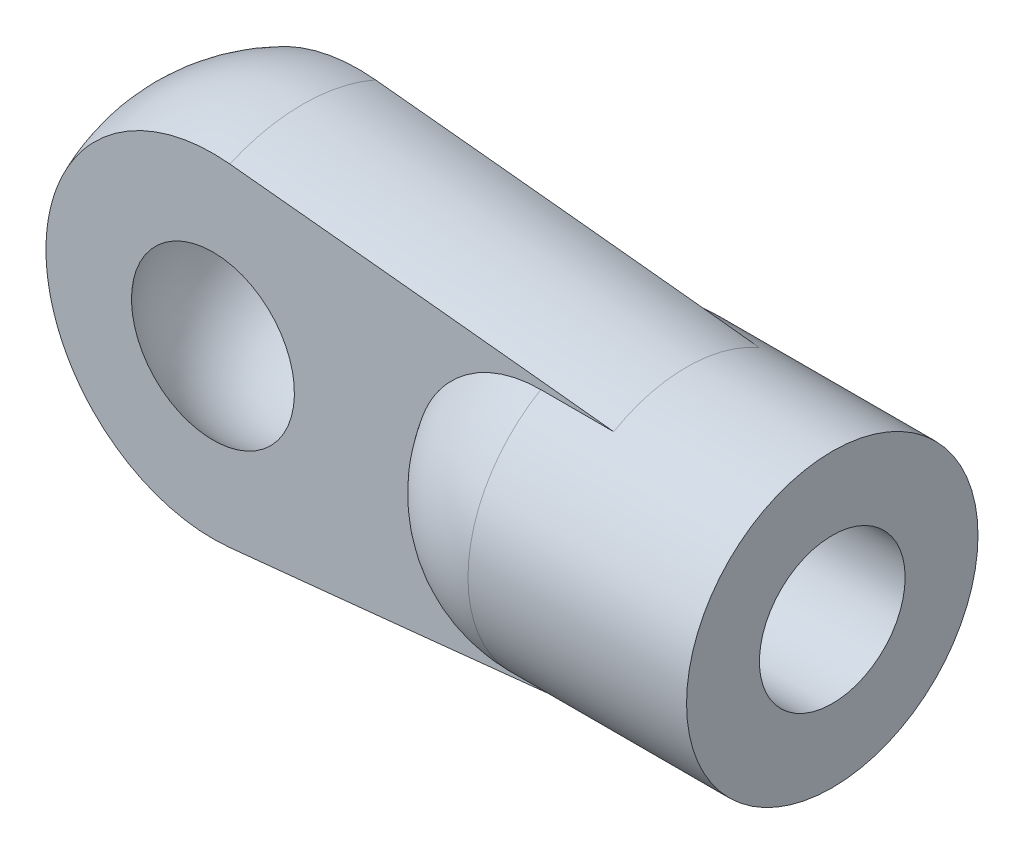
ISO-10303-21;
HEADER;
FILE_DESCRIPTION(('STEP AP214'),'2;1');
FILE_NAME('part.step','',(''),(''),'','','');
FILE_SCHEMA(('AUTOMOTIVE_DESIGN { 1 0 10303 214 1 1 1 1 }'));
ENDSEC;
DATA;
#1=APPLICATION_CONTEXT('core data for automotive mechanical design processes');
#2=APPLICATION_PROTOCOL_DEFINITION('international standard','automotive_design',2000,#1);
#3=PRODUCT_CONTEXT('',#1,'mechanical');
#4=PRODUCT('Part','Part','',(#3));
#5=PRODUCT_RELATED_PRODUCT_CATEGORY('part','',(#4));
#6=PRODUCT_DEFINITION_FORMATION('','',#4);
#7=PRODUCT_DEFINITION_CONTEXT('part definition',#1,'design');
#8=PRODUCT_DEFINITION('design','',#6,#7);
#9=PRODUCT_DEFINITION_SHAPE('','',#8);
#10=(LENGTH_UNIT() NAMED_UNIT(*) SI_UNIT(.MILLI.,.METRE.));
#11=(NAMED_UNIT(*) PLANE_ANGLE_UNIT() SI_UNIT($,.RADIAN.));
#12=(NAMED_UNIT(*) SI_UNIT($,.STERADIAN.) SOLID_ANGLE_UNIT());
#13=UNCERTAINTY_MEASURE_WITH_UNIT(LENGTH_MEASURE(1.E-05),#10,'distance_accuracy_value','');
#14=(GEOMETRIC_REPRESENTATION_CONTEXT(3) GLOBAL_UNCERTAINTY_ASSIGNED_CONTEXT((#13)) GLOBAL_UNIT_ASSIGNED_CONTEXT((#10,
#11,#12)) REPRESENTATION_CONTEXT('',''));
#15=CARTESIAN_POINT('',(0.,0.,0.));
#16=DIRECTION('',(0.,0.,1.));
#17=DIRECTION('',(1.,0.,0.));
#18=AXIS2_PLACEMENT_3D('',#15,#16,#17);
#19=CARTESIAN_POINT('',(11.,0.,0.));
#20=DIRECTION('',(-1.,0.,0.));
#21=DIRECTION('',(0.,0.,1.));
#22=AXIS2_PLACEMENT_3D('',#19,#20,#21);
#23=CONICAL_SURFACE('',#22,4.,0.0925992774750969);
#24=CARTESIAN_POINT('',(11.,0.,0.));
#25=DIRECTION('',(-1.,0.,0.));
#26=DIRECTION('',(0.,0.,1.));
#27=AXIS2_PLACEMENT_3D('',#24,#25,#26);
#28=CIRCLE('',#27,4.);
#29=CARTESIAN_POINT('',(11.,-3.46410161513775,-2.));
#30=VERTEX_POINT('',#29);
#31=CARTESIAN_POINT('',(11.,-3.46410161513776,2.));
#32=VERTEX_POINT('',#31);
#33=EDGE_CURVE('E471',#30,#32,#28,.T.);
#34=ORIENTED_EDGE('',*,*,#33,.T.);
#35=CARTESIAN_POINT('',(-6.98220210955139,-5.30546244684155,2.));
#36=CARTESIAN_POINT('',(-5.50974871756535,-5.15929263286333,2.));
#37=CARTESIAN_POINT('',(-4.03736127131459,-5.01244843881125,2.));
#38=CARTESIAN_POINT('',(-1.09276032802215,-4.71681204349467,2.));
#39=CARTESIAN_POINT('',(0.37945316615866,-4.56801981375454,2.));
#40=CARTESIAN_POINT('',(2.58757918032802,-4.34292420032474,2.));
#41=CARTESIAN_POINT('',(3.32358886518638,-4.26757444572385,2.));
#42=CARTESIAN_POINT('',(4.79553032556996,-4.11612257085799,2.));
#43=CARTESIAN_POINT('',(5.53146210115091,-4.04002045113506,2.));
#44=CARTESIAN_POINT('',(7.00322546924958,-3.88693041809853,2.));
#45=CARTESIAN_POINT('',(7.7390570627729,-3.80994251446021,2.));
#46=CARTESIAN_POINT('',(9.21061024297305,-3.65490405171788,2.));
#47=CARTESIAN_POINT('',(9.94633182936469,-3.57685348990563,2.));
#48=CARTESIAN_POINT('',(11.776502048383,-3.38108140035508,2.));
#49=CARTESIAN_POINT('',(12.8708675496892,-3.26258103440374,2.));
#50=CARTESIAN_POINT('',(15.0591660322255,-3.02170045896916,2.));
#51=CARTESIAN_POINT('',(16.1530990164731,-2.89932027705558,2.));
#52=CARTESIAN_POINT('',(17.7935393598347,-2.71151048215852,2.));
#53=CARTESIAN_POINT('',(18.3402890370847,-2.64819910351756,2.));
#54=CARTESIAN_POINT('',(19.4335798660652,-2.51981225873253,2.));
#55=CARTESIAN_POINT('',(19.9801210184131,-2.45473679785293,2.));
#56=CARTESIAN_POINT('',(21.0729521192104,-2.32238195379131,2.));
#57=CARTESIAN_POINT('',(21.6192420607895,-2.25510251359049,2.));
#58=CARTESIAN_POINT('',(22.7114573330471,-2.11760726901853,2.));
#59=CARTESIAN_POINT('',(23.2573826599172,-2.04739143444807,2.));
#60=CARTESIAN_POINT('',(23.803070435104,-1.97534106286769,2.));
#61=B_SPLINE_CURVE_WITH_KNOTS('',3,(#35,#36,#37,#38,#39,#40,#41,#42,#43,#44,#45,#46,#47,#48,#49,
#50,#51,#52,#53,#54,#55,#56,#57,#58,#59,#60),.UNSPECIFIED.,.F.,.F.,(4,2,2,2,2,2,2,2,2,2,2,2,4),
(0.,4.43907358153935,8.87821212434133,11.0977817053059,13.3173496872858,15.5368934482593,
17.7564428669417,21.0587261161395,24.3609859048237,26.0121928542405,27.6633948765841,
29.3146396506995,30.9659014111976),.UNSPECIFIED.);
#62=CARTESIAN_POINT('',(0.462335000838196,-4.55919360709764,2.));
#63=VERTEX_POINT('',#62);
#64=EDGE_CURVE('E430',#32,#63,#61,.F.);
#65=ORIENTED_EDGE('',*,*,#64,.T.);
#66=CARTESIAN_POINT('',(0.462335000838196,0.,0.));
#67=DIRECTION('',(-1.,0.,0.));
#68=DIRECTION('',(0.,0.,1.));
#69=AXIS2_PLACEMENT_3D('',#66,#67,#68);
#70=CIRCLE('',#69,4.97857874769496);
#71=CARTESIAN_POINT('',(0.462335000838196,-4.55919360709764,-2.));
#72=VERTEX_POINT('',#71);
#73=EDGE_CURVE('E467',#72,#63,#70,.T.);
#74=ORIENTED_EDGE('',*,*,#73,.F.);
#75=CARTESIAN_POINT('',(-6.98220210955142,-5.30546244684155,-2.));
#76=CARTESIAN_POINT('',(-5.50974871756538,-5.15929263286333,-2.));
#77=CARTESIAN_POINT('',(-4.03736127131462,-5.01244843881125,-2.));
#78=CARTESIAN_POINT('',(-1.09276032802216,-4.71681204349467,-2.));
#79=CARTESIAN_POINT('',(0.379453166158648,-4.56801981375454,-2.));
#80=CARTESIAN_POINT('',(2.58757918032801,-4.34292420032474,-2.));
#81=CARTESIAN_POINT('',(3.32358886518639,-4.26757444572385,-2.));
#82=CARTESIAN_POINT('',(4.79553032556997,-4.11612257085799,-2.));
#83=CARTESIAN_POINT('',(5.53146210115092,-4.04002045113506,-2.));
#84=CARTESIAN_POINT('',(7.0032254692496,-3.88693041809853,-2.));
#85=CARTESIAN_POINT('',(7.73905706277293,-3.8099425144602,-2.));
#86=CARTESIAN_POINT('',(9.21061024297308,-3.65490405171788,-2.));
#87=CARTESIAN_POINT('',(9.94633182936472,-3.57685348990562,-2.));
#88=CARTESIAN_POINT('',(11.776502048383,-3.38108140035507,-2.));
#89=CARTESIAN_POINT('',(12.8708675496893,-3.26258103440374,-2.));
#90=CARTESIAN_POINT('',(15.0591660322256,-3.02170045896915,-2.));
#91=CARTESIAN_POINT('',(16.1530990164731,-2.89932027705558,-2.));
#92=CARTESIAN_POINT('',(17.7935393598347,-2.71151048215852,-2.));
#93=CARTESIAN_POINT('',(18.3402890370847,-2.64819910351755,-2.));
#94=CARTESIAN_POINT('',(19.4335798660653,-2.51981225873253,-2.));
#95=CARTESIAN_POINT('',(19.9801210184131,-2.45473679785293,-2.));
#96=CARTESIAN_POINT('',(21.0729521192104,-2.32238195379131,-2.));
#97=CARTESIAN_POINT('',(21.6192420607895,-2.25510251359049,-2.));
#98=CARTESIAN_POINT('',(22.7114573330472,-2.11760726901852,-2.));
#99=CARTESIAN_POINT('',(23.2573826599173,-2.04739143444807,-2.));
#100=CARTESIAN_POINT('',(23.803070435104,-1.97534106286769,-2.));
#101=B_SPLINE_CURVE_WITH_KNOTS('',3,(#75,#76,#77,#78,#79,#80,#81,#82,#83,#84,#85,#86,#87,#88,
#89,#90,#91,#92,#93,#94,#95,#96,#97,#98,#99,#100),.UNSPECIFIED.,.F.,.F.,(4,2,2,2,2,2,2,2,2,2,2,
2,4),(0.,4.43907358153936,8.87821212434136,11.0977817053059,13.3173496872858,15.5368934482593,
17.7564428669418,21.0587261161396,24.3609859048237,26.0121928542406,27.6633948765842,
29.3146396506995,30.9659014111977),.UNSPECIFIED.);
#102=EDGE_CURVE('E460',#72,#30,#101,.T.);
#103=ORIENTED_EDGE('',*,*,#102,.T.);
#104=EDGE_LOOP('',(#34,#65,#74,#103));
#105=FACE_BOUND('',#104,.T.);
#106=ADVANCED_FACE('F350',(#105),#23,.T.);
#107=CARTESIAN_POINT('',(0.,0.,0.));
#108=DIRECTION('',(-1.,0.,0.));
#109=DIRECTION('',(0.,-1.,0.));
#110=AXIS2_PLACEMENT_3D('',#107,#108,#109);
#111=SPHERICAL_SURFACE('',#110,3.);
#112=CARTESIAN_POINT('',(0.,0.,0.));
#113=DIRECTION('',(0.,0.,-1.));
#114=DIRECTION('',(0.,1.,0.));
#115=AXIS2_PLACEMENT_3D('',#112,#113,#114);
#116=SPHERICAL_SURFACE('',#115,3.);
#117=CARTESIAN_POINT('',(0.,0.,2.));
#118=DIRECTION('',(0.,0.,-1.));
#119=DIRECTION('',(0.,1.,0.));
#120=AXIS2_PLACEMENT_3D('',#117,#118,#119);
#121=CIRCLE('',#120,2.23606797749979);
#122=CARTESIAN_POINT('',(0.,2.23606797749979,2.));
#123=VERTEX_POINT('',#122);
#124=EDGE_CURVE('E482',#123,#123,#121,.F.);
#125=ORIENTED_EDGE('',*,*,#124,.T.);
#126=EDGE_LOOP('',(#125));
#127=FACE_BOUND('',#126,.T.);
#128=CARTESIAN_POINT('',(0.,0.,-2.));
#129=DIRECTION('',(0.,0.,1.));
#130=DIRECTION('',(0.,-1.,0.));
#131=AXIS2_PLACEMENT_3D('',#128,#129,#130);
#132=CIRCLE('',#131,2.23606797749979);
#133=CARTESIAN_POINT('',(0.,-2.23606797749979,-2.));
#134=VERTEX_POINT('',#133);
#135=EDGE_CURVE('E478',#134,#134,#132,.F.);
#136=ORIENTED_EDGE('',*,*,#135,.T.);
#137=EDGE_LOOP('',(#136));
#138=FACE_BOUND('',#137,.T.);
#139=ADVANCED_FACE('F451',(#127,#138),#116,.F.);
#140=CARTESIAN_POINT('',(-5.,5.9284103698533,-2.));
#141=DIRECTION('',(0.,0.,1.));
#142=DIRECTION('',(0.,-1.,0.));
#143=AXIS2_PLACEMENT_3D('',#140,#141,#142);
#144=PLANE('',#143);
#145=ORIENTED_EDGE('',*,*,#135,.F.);
#146=EDGE_LOOP('',(#145));
#147=FACE_BOUND('',#146,.T.);
#148=CARTESIAN_POINT('',(9.,0.,-2.));
#149=DIRECTION('',(0.,0.,1.));
#150=DIRECTION('',(0.,-1.,0.));
#151=AXIS2_PLACEMENT_3D('',#148,#149,#150);
#152=CIRCLE('',#151,3.46410161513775);
#153=CARTESIAN_POINT('',(9.,3.46410161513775,-2.));
#154=VERTEX_POINT('',#153);
#155=CARTESIAN_POINT('',(9.,-3.46410161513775,-2.));
#156=VERTEX_POINT('',#155);
#157=EDGE_CURVE('E400',#154,#156,#152,.T.);
#158=ORIENTED_EDGE('',*,*,#157,.T.);
#159=DIRECTION('',(1.,0.,0.));
#160=VECTOR('',#159,1.);
#161=CARTESIAN_POINT('',(15.7909156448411,-3.46410161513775,-2.));
#162=LINE('',#161,#160);
#163=EDGE_CURVE('E411',#156,#30,#162,.T.);
#164=ORIENTED_EDGE('',*,*,#163,.T.);
#165=ORIENTED_EDGE('',*,*,#102,.F.);
#166=CARTESIAN_POINT('',(0.,0.,-2.));
#167=DIRECTION('',(0.,0.,1.));
#168=DIRECTION('',(0.,-1.,0.));
#169=AXIS2_PLACEMENT_3D('',#166,#167,#168);
#170=CIRCLE('',#169,4.58257569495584);
#171=CARTESIAN_POINT('',(0.462335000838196,4.55919360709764,-2.));
#172=VERTEX_POINT('',#171);
#173=EDGE_CURVE('E481',#172,#72,#170,.T.);
#174=ORIENTED_EDGE('',*,*,#173,.F.);
#175=CARTESIAN_POINT('',(-6.98220210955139,5.30546244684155,-2.));
#176=CARTESIAN_POINT('',(-5.50974871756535,5.15929263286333,-2.));
#177=CARTESIAN_POINT('',(-4.03736127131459,5.01244843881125,-2.));
#178=CARTESIAN_POINT('',(-1.09276032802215,4.71681204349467,-2.));
#179=CARTESIAN_POINT('',(0.379453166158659,4.56801981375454,-2.));
#180=CARTESIAN_POINT('',(2.58757918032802,4.34292420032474,-2.));
#181=CARTESIAN_POINT('',(3.32358886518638,4.26757444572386,-2.));
#182=CARTESIAN_POINT('',(4.79553032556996,4.11612257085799,-2.));
#183=CARTESIAN_POINT('',(5.53146210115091,4.04002045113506,-2.));
#184=CARTESIAN_POINT('',(7.00322546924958,3.88693041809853,-2.));
#185=CARTESIAN_POINT('',(7.7390570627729,3.80994251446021,-2.));
#186=CARTESIAN_POINT('',(9.21061024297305,3.65490405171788,-2.));
#187=CARTESIAN_POINT('',(9.94633182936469,3.57685348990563,-2.));
#188=CARTESIAN_POINT('',(11.776502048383,3.38108140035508,-2.));
#189=CARTESIAN_POINT('',(12.8708675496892,3.26258103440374,-2.));
#190=CARTESIAN_POINT('',(15.0591660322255,3.02170045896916,-2.));
#191=CARTESIAN_POINT('',(16.1530990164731,2.89932027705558,-2.));
#192=CARTESIAN_POINT('',(17.7935393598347,2.71151048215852,-2.));
#193=CARTESIAN_POINT('',(18.3402890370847,2.64819910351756,-2.));
#194=CARTESIAN_POINT('',(19.4335798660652,2.51981225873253,-2.));
#195=CARTESIAN_POINT('',(19.9801210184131,2.45473679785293,-2.));
#196=CARTESIAN_POINT('',(21.0729521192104,2.32238195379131,-2.));
#197=CARTESIAN_POINT('',(21.6192420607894,2.25510251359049,-2.));
#198=CARTESIAN_POINT('',(22.7114573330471,2.11760726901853,-2.));
#199=CARTESIAN_POINT('',(23.2573826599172,2.04739143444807,-2.));
#200=CARTESIAN_POINT('',(23.803070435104,1.97534106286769,-2.));
#201=B_SPLINE_CURVE_WITH_KNOTS('',3,(#175,#176,#177,#178,#179,#180,#181,#182,#183,#184,#185,
#186,#187,#188,#189,#190,#191,#192,#193,#194,#195,#196,#197,#198,#199,#200),.UNSPECIFIED.,.F.,
.F.,(4,2,2,2,2,2,2,2,2,2,2,2,4),(0.,4.43907358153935,8.87821212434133,11.0977817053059,
13.3173496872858,15.5368934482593,17.7564428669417,21.0587261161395,24.3609859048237,
26.0121928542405,27.6633948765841,29.3146396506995,30.9659014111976),.UNSPECIFIED.);
#202=CARTESIAN_POINT('',(11.,3.46410161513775,-2.));
#203=VERTEX_POINT('',#202);
#204=EDGE_CURVE('E418',#203,#172,#201,.F.);
#205=ORIENTED_EDGE('',*,*,#204,.F.);
#206=DIRECTION('',(1.,0.,0.));
#207=VECTOR('',#206,1.);
#208=CARTESIAN_POINT('',(15.7909156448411,3.46410161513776,-2.));
#209=LINE('',#208,#207);
#210=EDGE_CURVE('E404',#203,#154,#209,.F.);
#211=ORIENTED_EDGE('',*,*,#210,.T.);
#212=EDGE_LOOP('',(#158,#164,#165,#174,#205,#211));
#213=FACE_BOUND('',#212,.T.);
#214=ADVANCED_FACE('F415',(#147,#213),#144,.F.);
#215=CARTESIAN_POINT('',(15.,0.,0.));
#216=DIRECTION('',(-1.,0.,0.));
#217=DIRECTION('',(0.,0.,1.));
#218=AXIS2_PLACEMENT_3D('',#215,#216,#217);
#219=PLANE('',#218);
#220=CARTESIAN_POINT('',(15.,0.,0.));
#221=DIRECTION('',(1.,0.,0.));
#222=DIRECTION('',(0.,0.,-1.));
#223=AXIS2_PLACEMENT_3D('',#220,#221,#222);
#224=CIRCLE('',#223,2.);
#225=CARTESIAN_POINT('',(15.,0.,-2.));
#226=VERTEX_POINT('',#225);
#227=EDGE_CURVE('E494',#226,#226,#224,.T.);
#228=ORIENTED_EDGE('',*,*,#227,.F.);
#229=EDGE_LOOP('',(#228));
#230=FACE_BOUND('',#229,.T.);
#231=CARTESIAN_POINT('',(15.,0.,0.));
#232=DIRECTION('',(-1.,0.,0.));
#233=DIRECTION('',(0.,0.,1.));
#234=AXIS2_PLACEMENT_3D('',#231,#232,#233);
#235=CIRCLE('',#234,4.);
#236=CARTESIAN_POINT('',(15.,0.,4.));
#237=VERTEX_POINT('',#236);
#238=EDGE_CURVE('E474',#237,#237,#235,.T.);
#239=ORIENTED_EDGE('',*,*,#238,.F.);
#240=EDGE_LOOP('',(#239));
#241=FACE_BOUND('',#240,.T.);
#242=ADVANCED_FACE('F352',(#230,#241),#219,.F.);
#243=CARTESIAN_POINT('',(-6.79728202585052,0.,0.));
#244=DIRECTION('',(-1.,0.,0.));
#245=DIRECTION('',(0.,0.,1.));
#246=AXIS2_PLACEMENT_3D('',#243,#244,#245);
#247=CYLINDRICAL_SURFACE('',#246,4.);
#248=ORIENTED_EDGE('',*,*,#238,.T.);
#249=EDGE_LOOP('',(#248));
#250=FACE_BOUND('',#249,.T.);
#251=CARTESIAN_POINT('',(11.,3.46410161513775,2.));
#252=VERTEX_POINT('',#251);
#253=EDGE_CURVE('E470',#252,#203,#28,.T.);
#254=ORIENTED_EDGE('',*,*,#253,.F.);
#255=DIRECTION('',(1.,0.,0.));
#256=VECTOR('',#255,1.);
#257=CARTESIAN_POINT('',(15.7909156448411,3.46410161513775,2.));
#258=LINE('',#257,#256);
#259=CARTESIAN_POINT('',(9.,3.46410161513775,2.));
#260=VERTEX_POINT('',#259);
#261=EDGE_CURVE('E11',#260,#252,#258,.T.);
#262=ORIENTED_EDGE('',*,*,#261,.F.);
#263=CARTESIAN_POINT('',(9.,0.,0.));
#264=DIRECTION('',(1.,0.,0.));
#265=DIRECTION('',(0.,0.,-1.));
#266=AXIS2_PLACEMENT_3D('',#263,#264,#265);
#267=CIRCLE('',#266,4.);
#268=CARTESIAN_POINT('',(9.,-3.46410161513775,2.));
#269=VERTEX_POINT('',#268);
#270=EDGE_CURVE('E371',#260,#269,#267,.T.);
#271=ORIENTED_EDGE('',*,*,#270,.T.);
#272=DIRECTION('',(1.,0.,0.));
#273=VECTOR('',#272,1.);
#274=CARTESIAN_POINT('',(15.7909156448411,-3.46410161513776,2.));
#275=LINE('',#274,#273);
#276=EDGE_CURVE('E358',#32,#269,#275,.F.);
#277=ORIENTED_EDGE('',*,*,#276,.F.);
#278=ORIENTED_EDGE('',*,*,#33,.F.);
#279=ORIENTED_EDGE('',*,*,#163,.F.);
#280=EDGE_CURVE('E364',#156,#154,#267,.T.);
#281=ORIENTED_EDGE('',*,*,#280,.T.);
#282=ORIENTED_EDGE('',*,*,#210,.F.);
#283=EDGE_LOOP('',(#254,#262,#271,#277,#278,#279,#281,#282));
#284=FACE_BOUND('',#283,.T.);
#285=ADVANCED_FACE('F408',(#250,#284),#247,.T.);
#286=CARTESIAN_POINT('',(0.462335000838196,4.55919360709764,2.));
#287=VERTEX_POINT('',#286);
#288=EDGE_CURVE('E466',#287,#172,#70,.T.);
#289=ORIENTED_EDGE('',*,*,#288,.F.);
#290=CARTESIAN_POINT('',(-6.98220210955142,5.30546244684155,2.));
#291=CARTESIAN_POINT('',(-5.50974871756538,5.15929263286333,2.));
#292=CARTESIAN_POINT('',(-4.03736127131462,5.01244843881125,2.));
#293=CARTESIAN_POINT('',(-1.09276032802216,4.71681204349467,2.));
#294=CARTESIAN_POINT('',(0.379453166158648,4.56801981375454,2.));
#295=CARTESIAN_POINT('',(2.58757918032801,4.34292420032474,2.));
#296=CARTESIAN_POINT('',(3.32358886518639,4.26757444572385,2.));
#297=CARTESIAN_POINT('',(4.79553032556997,4.11612257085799,2.));
#298=CARTESIAN_POINT('',(5.53146210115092,4.04002045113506,2.));
#299=CARTESIAN_POINT('',(7.0032254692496,3.88693041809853,2.));
#300=CARTESIAN_POINT('',(7.73905706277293,3.8099425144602,2.));
#301=CARTESIAN_POINT('',(9.21061024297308,3.65490405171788,2.));
#302=CARTESIAN_POINT('',(9.94633182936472,3.57685348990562,2.));
#303=CARTESIAN_POINT('',(11.776502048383,3.38108140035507,2.));
#304=CARTESIAN_POINT('',(12.8708675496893,3.26258103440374,2.));
#305=CARTESIAN_POINT('',(15.0591660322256,3.02170045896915,2.));
#306=CARTESIAN_POINT('',(16.1530990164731,2.89932027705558,2.));
#307=CARTESIAN_POINT('',(17.7935393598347,2.71151048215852,2.));
#308=CARTESIAN_POINT('',(18.3402890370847,2.64819910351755,2.));
#309=CARTESIAN_POINT('',(19.4335798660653,2.51981225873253,2.));
#310=CARTESIAN_POINT('',(19.9801210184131,2.45473679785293,2.));
#311=CARTESIAN_POINT('',(21.0729521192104,2.32238195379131,2.));
#312=CARTESIAN_POINT('',(21.6192420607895,2.25510251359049,2.));
#313=CARTESIAN_POINT('',(22.7114573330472,2.11760726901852,2.));
#314=CARTESIAN_POINT('',(23.2573826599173,2.04739143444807,2.));
#315=CARTESIAN_POINT('',(23.803070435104,1.97534106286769,2.));
#316=B_SPLINE_CURVE_WITH_KNOTS('',3,(#290,#291,#292,#293,#294,#295,#296,#297,#298,#299,#300,
#301,#302,#303,#304,#305,#306,#307,#308,#309,#310,#311,#312,#313,#314,#315),.UNSPECIFIED.,.F.,
.F.,(4,2,2,2,2,2,2,2,2,2,2,2,4),(0.,4.43907358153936,8.87821212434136,11.0977817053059,
13.3173496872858,15.5368934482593,17.7564428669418,21.0587261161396,24.3609859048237,
26.0121928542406,27.6633948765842,29.3146396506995,30.9659014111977),.UNSPECIFIED.);
#317=EDGE_CURVE('E420',#287,#252,#316,.T.);
#318=ORIENTED_EDGE('',*,*,#317,.T.);
#319=ORIENTED_EDGE('',*,*,#253,.T.);
#320=ORIENTED_EDGE('',*,*,#204,.T.);
#321=EDGE_LOOP('',(#289,#318,#319,#320));
#322=FACE_BOUND('',#321,.T.);
#323=ADVANCED_FACE('F435',(#322),#23,.T.);
#324=CARTESIAN_POINT('',(0.,0.,0.));
#325=DIRECTION('',(-1.,0.,0.));
#326=DIRECTION('',(0.,1.,0.));
#327=AXIS2_PLACEMENT_3D('',#324,#325,#326);
#328=SPHERICAL_SURFACE('',#327,5.);
#329=ORIENTED_EDGE('',*,*,#73,.T.);
#330=CARTESIAN_POINT('',(0.,0.,2.));
#331=DIRECTION('',(0.,0.,-1.));
#332=DIRECTION('',(0.,1.,0.));
#333=AXIS2_PLACEMENT_3D('',#330,#331,#332);
#334=CIRCLE('',#333,4.58257569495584);
#335=EDGE_CURVE('E477',#63,#287,#334,.T.);
#336=ORIENTED_EDGE('',*,*,#335,.T.);
#337=ORIENTED_EDGE('',*,*,#288,.T.);
#338=ORIENTED_EDGE('',*,*,#173,.T.);
#339=EDGE_LOOP('',(#329,#336,#337,#338));
#340=FACE_BOUND('',#339,.T.);
#341=ADVANCED_FACE('F444',(#340),#328,.T.);
#342=CARTESIAN_POINT('',(-5.,5.9284103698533,2.));
#343=DIRECTION('',(0.,0.,-1.));
#344=DIRECTION('',(0.,1.,0.));
#345=AXIS2_PLACEMENT_3D('',#342,#343,#344);
#346=PLANE('',#345);
#347=CARTESIAN_POINT('',(9.,0.,2.));
#348=DIRECTION('',(0.,0.,-1.));
#349=DIRECTION('',(0.,1.,0.));
#350=AXIS2_PLACEMENT_3D('',#347,#348,#349);
#351=CIRCLE('',#350,3.46410161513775);
#352=EDGE_CURVE('E485',#269,#260,#351,.T.);
#353=ORIENTED_EDGE('',*,*,#352,.T.);
#354=ORIENTED_EDGE('',*,*,#261,.T.);
#355=ORIENTED_EDGE('',*,*,#317,.F.);
#356=ORIENTED_EDGE('',*,*,#335,.F.);
#357=ORIENTED_EDGE('',*,*,#64,.F.);
#358=ORIENTED_EDGE('',*,*,#276,.T.);
#359=EDGE_LOOP('',(#353,#354,#355,#356,#357,#358));
#360=FACE_BOUND('',#359,.T.);
#361=ORIENTED_EDGE('',*,*,#124,.F.);
#362=EDGE_LOOP('',(#361));
#363=FACE_BOUND('',#362,.T.);
#364=ADVANCED_FACE('F438',(#360,#363),#346,.F.);
#365=CARTESIAN_POINT('',(9.,0.,0.));
#366=DIRECTION('',(1.,0.,0.));
#367=DIRECTION('',(0.,1.,0.));
#368=AXIS2_PLACEMENT_3D('',#365,#366,#367);
#369=SPHERICAL_SURFACE('',#368,4.);
#370=ORIENTED_EDGE('',*,*,#352,.F.);
#371=ORIENTED_EDGE('',*,*,#270,.F.);
#372=EDGE_LOOP('',(#370,#371));
#373=FACE_BOUND('',#372,.T.);
#374=ADVANCED_FACE('F443',(#373),#369,.T.);
#375=ORIENTED_EDGE('',*,*,#157,.F.);
#376=ORIENTED_EDGE('',*,*,#280,.F.);
#377=EDGE_LOOP('',(#375,#376));
#378=FACE_BOUND('',#377,.T.);
#379=ADVANCED_FACE('F401',(#378),#369,.T.);
#380=CARTESIAN_POINT('',(9.,0.,0.));
#381=DIRECTION('',(1.,0.,0.));
#382=DIRECTION('',(0.,0.,-1.));
#383=AXIS2_PLACEMENT_3D('',#380,#381,#382);
#384=CYLINDRICAL_SURFACE('',#383,2.);
#385=CARTESIAN_POINT('',(9.,0.,0.));
#386=DIRECTION('',(1.,0.,0.));
#387=DIRECTION('',(0.,0.,-1.));
#388=AXIS2_PLACEMENT_3D('',#385,#386,#387);
#389=CIRCLE('',#388,2.);
#390=CARTESIAN_POINT('',(9.,0.,-2.));
#391=VERTEX_POINT('',#390);
#392=EDGE_CURVE('E412',#391,#391,#389,.T.);
#393=ORIENTED_EDGE('',*,*,#392,.F.);
#394=EDGE_LOOP('',(#393));
#395=FACE_BOUND('',#394,.T.);
#396=ORIENTED_EDGE('',*,*,#227,.T.);
#397=EDGE_LOOP('',(#396));
#398=FACE_BOUND('',#397,.T.);
#399=ADVANCED_FACE('F498',(#395,#398),#384,.F.);
#400=CARTESIAN_POINT('',(9.,0.,0.));
#401=DIRECTION('',(1.,0.,0.));
#402=DIRECTION('',(0.,0.,-1.));
#403=AXIS2_PLACEMENT_3D('',#400,#401,#402);
#404=PLANE('',#403);
#405=ORIENTED_EDGE('',*,*,#392,.T.);
#406=EDGE_LOOP('',(#405));
#407=FACE_BOUND('',#406,.T.);
#408=ADVANCED_FACE('F551',(#407),#404,.T.);
#409=CLOSED_SHELL('',(#106,#139,#214,#242,#285,#323,#341,#364,#374,#379,#399,#408));
#410=MANIFOLD_SOLID_BREP('B2',#409);
#411=ADVANCED_BREP_SHAPE_REPRESENTATION('',(#18,#410),#14);
#412=SHAPE_DEFINITION_REPRESENTATION(#9,#411);
ENDSEC;
END-ISO-10303-21;
